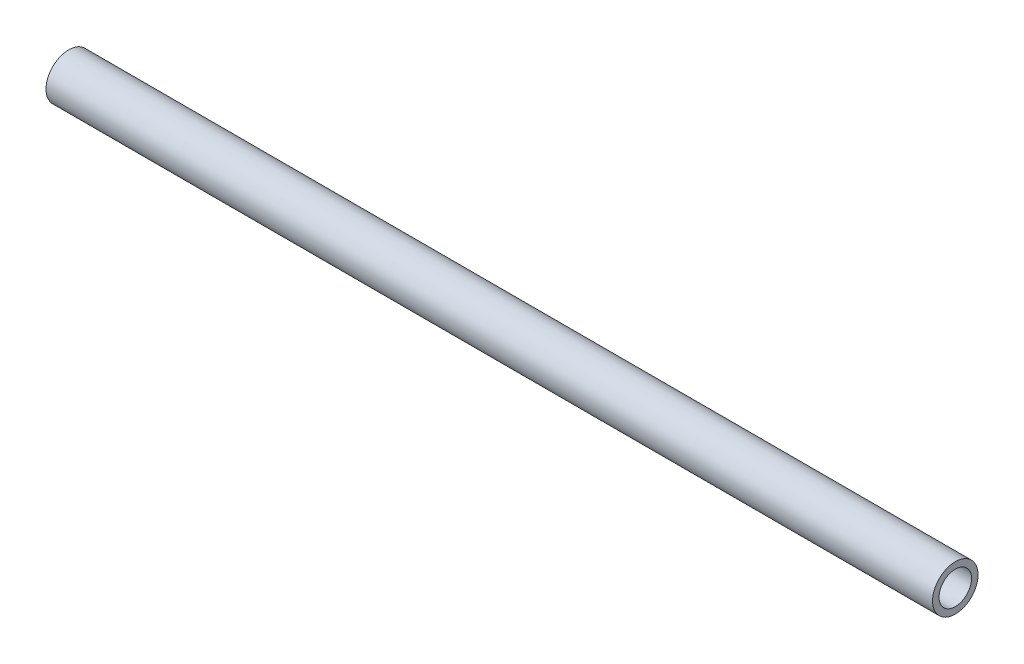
ISO-10303-21;
HEADER;
FILE_DESCRIPTION(('STEP AP214'),'2;1');
FILE_NAME('part.step','',(''),(''),'','','');
FILE_SCHEMA(('AUTOMOTIVE_DESIGN { 1 0 10303 214 1 1 1 1 }'));
ENDSEC;
DATA;
#1=APPLICATION_CONTEXT('core data for automotive mechanical design processes');
#2=APPLICATION_PROTOCOL_DEFINITION('international standard','automotive_design',2000,#1);
#3=PRODUCT_CONTEXT('',#1,'mechanical');
#4=PRODUCT('Part','Part','',(#3));
#5=PRODUCT_RELATED_PRODUCT_CATEGORY('part','',(#4));
#6=PRODUCT_DEFINITION_FORMATION('','',#4);
#7=PRODUCT_DEFINITION_CONTEXT('part definition',#1,'design');
#8=PRODUCT_DEFINITION('design','',#6,#7);
#9=PRODUCT_DEFINITION_SHAPE('','',#8);
#10=(LENGTH_UNIT() NAMED_UNIT(*) SI_UNIT(.MILLI.,.METRE.));
#11=(NAMED_UNIT(*) PLANE_ANGLE_UNIT() SI_UNIT($,.RADIAN.));
#12=(NAMED_UNIT(*) SI_UNIT($,.STERADIAN.) SOLID_ANGLE_UNIT());
#13=UNCERTAINTY_MEASURE_WITH_UNIT(LENGTH_MEASURE(1.E-05),#10,'distance_accuracy_value','');
#14=(GEOMETRIC_REPRESENTATION_CONTEXT(3) GLOBAL_UNCERTAINTY_ASSIGNED_CONTEXT((#13)) GLOBAL_UNIT_ASSIGNED_CONTEXT((#10,
#11,#12)) REPRESENTATION_CONTEXT('',''));
#15=CARTESIAN_POINT('',(0.,0.,0.));
#16=DIRECTION('',(0.,0.,1.));
#17=DIRECTION('',(1.,0.,0.));
#18=AXIS2_PLACEMENT_3D('',#15,#16,#17);
#19=CARTESIAN_POINT('',(415.925,0.,0.));
#20=DIRECTION('',(-1.,0.,0.));
#21=DIRECTION('',(0.,0.,1.));
#22=AXIS2_PLACEMENT_3D('',#19,#20,#21);
#23=CYLINDRICAL_SURFACE('',#22,7.62);
#24=CARTESIAN_POINT('',(415.925,0.,0.));
#25=DIRECTION('',(1.,0.,0.));
#26=DIRECTION('',(0.,0.,-1.));
#27=AXIS2_PLACEMENT_3D('',#24,#25,#26);
#28=CIRCLE('',#27,7.62);
#29=CARTESIAN_POINT('',(415.925,0.,7.62));
#30=VERTEX_POINT('',#29);
#31=EDGE_CURVE('E53',#30,#30,#28,.T.);
#32=CARTESIAN_POINT('',(0.,0.,0.));
#33=DIRECTION('',(1.,0.,0.));
#34=DIRECTION('',(0.,0.,-1.));
#35=AXIS2_PLACEMENT_3D('',#32,#33,#34);
#36=CIRCLE('',#35,7.62);
#37=CARTESIAN_POINT('',(0.,0.,7.62));
#38=VERTEX_POINT('',#37);
#39=EDGE_CURVE('E60',#38,#38,#36,.T.);
#40=CARTESIAN_POINT('',(415.925,0.,7.62));
#41=CARTESIAN_POINT('',(411.592447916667,0.,7.62));
#42=CARTESIAN_POINT('',(407.259895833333,0.,7.62));
#43=CARTESIAN_POINT('',(398.594791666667,0.,7.62));
#44=CARTESIAN_POINT('',(394.262239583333,0.,7.62));
#45=CARTESIAN_POINT('',(385.597135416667,0.,7.62));
#46=CARTESIAN_POINT('',(381.264583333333,0.,7.62));
#47=CARTESIAN_POINT('',(372.599479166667,0.,7.62));
#48=CARTESIAN_POINT('',(368.266927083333,0.,7.62));
#49=CARTESIAN_POINT('',(359.601822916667,0.,7.62));
#50=CARTESIAN_POINT('',(355.269270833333,0.,7.62));
#51=CARTESIAN_POINT('',(346.604166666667,0.,7.62));
#52=CARTESIAN_POINT('',(342.271614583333,0.,7.62));
#53=CARTESIAN_POINT('',(333.606510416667,0.,7.62));
#54=CARTESIAN_POINT('',(329.273958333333,0.,7.62));
#55=CARTESIAN_POINT('',(320.608854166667,0.,7.62));
#56=CARTESIAN_POINT('',(316.276302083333,0.,7.62));
#57=CARTESIAN_POINT('',(307.611197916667,0.,7.62));
#58=CARTESIAN_POINT('',(303.278645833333,0.,7.62));
#59=CARTESIAN_POINT('',(294.613541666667,0.,7.62));
#60=CARTESIAN_POINT('',(290.280989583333,0.,7.62));
#61=CARTESIAN_POINT('',(281.615885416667,0.,7.62));
#62=CARTESIAN_POINT('',(277.283333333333,0.,7.62));
#63=CARTESIAN_POINT('',(268.618229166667,0.,7.62));
#64=CARTESIAN_POINT('',(264.285677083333,0.,7.62));
#65=CARTESIAN_POINT('',(255.620572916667,0.,7.62));
#66=CARTESIAN_POINT('',(251.288020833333,0.,7.62));
#67=CARTESIAN_POINT('',(242.622916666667,0.,7.62));
#68=CARTESIAN_POINT('',(238.290364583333,0.,7.62));
#69=CARTESIAN_POINT('',(229.625260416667,0.,7.62));
#70=CARTESIAN_POINT('',(225.292708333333,0.,7.62));
#71=CARTESIAN_POINT('',(216.627604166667,0.,7.62));
#72=CARTESIAN_POINT('',(212.295052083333,0.,7.62));
#73=CARTESIAN_POINT('',(203.629947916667,0.,7.62));
#74=CARTESIAN_POINT('',(199.297395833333,0.,7.62));
#75=CARTESIAN_POINT('',(190.632291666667,0.,7.62));
#76=CARTESIAN_POINT('',(186.299739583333,0.,7.62));
#77=CARTESIAN_POINT('',(177.634635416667,0.,7.62));
#78=CARTESIAN_POINT('',(173.302083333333,0.,7.62));
#79=CARTESIAN_POINT('',(164.636979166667,0.,7.62));
#80=CARTESIAN_POINT('',(160.304427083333,0.,7.62));
#81=CARTESIAN_POINT('',(151.639322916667,0.,7.62));
#82=CARTESIAN_POINT('',(147.306770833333,0.,7.62));
#83=CARTESIAN_POINT('',(138.641666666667,0.,7.62));
#84=CARTESIAN_POINT('',(134.309114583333,0.,7.62));
#85=CARTESIAN_POINT('',(125.644010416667,0.,7.62));
#86=CARTESIAN_POINT('',(121.311458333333,0.,7.62));
#87=CARTESIAN_POINT('',(112.646354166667,0.,7.62));
#88=CARTESIAN_POINT('',(108.313802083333,0.,7.62));
#89=CARTESIAN_POINT('',(99.6486979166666,0.,7.62));
#90=CARTESIAN_POINT('',(95.3161458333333,0.,7.62));
#91=CARTESIAN_POINT('',(86.6510416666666,0.,7.62));
#92=CARTESIAN_POINT('',(82.3184895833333,0.,7.62));
#93=CARTESIAN_POINT('',(73.6533854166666,0.,7.62));
#94=CARTESIAN_POINT('',(69.3208333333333,0.,7.62));
#95=CARTESIAN_POINT('',(60.6557291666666,0.,7.62));
#96=CARTESIAN_POINT('',(56.3231770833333,0.,7.62));
#97=CARTESIAN_POINT('',(47.6580729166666,0.,7.62));
#98=CARTESIAN_POINT('',(43.3255208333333,0.,7.62));
#99=CARTESIAN_POINT('',(34.6604166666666,0.,7.62));
#100=CARTESIAN_POINT('',(30.3278645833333,0.,7.62));
#101=CARTESIAN_POINT('',(21.6627604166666,0.,7.62));
#102=CARTESIAN_POINT('',(17.3302083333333,0.,7.62));
#103=CARTESIAN_POINT('',(8.66510416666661,0.,7.62));
#104=CARTESIAN_POINT('',(4.33255208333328,0.,7.62));
#105=CARTESIAN_POINT('',(0.,0.,7.62));
#106=B_SPLINE_CURVE_WITH_KNOTS('',3,(#40,#41,#42,#43,#44,#45,#46,#47,#48,#49,#50,#51,#52,#53,
#54,#55,#56,#57,#58,#59,#60,#61,#62,#63,#64,#65,#66,#67,#68,#69,#70,#71,#72,#73,#74,#75,#76,#77,
#78,#79,#80,#81,#82,#83,#84,#85,#86,#87,#88,#89,#90,#91,#92,#93,#94,#95,#96,#97,#98,#99,#100,
#101,#102,#103,#104,#105),.UNSPECIFIED.,.F.,.F.,(4,2,2,2,2,2,2,2,2,2,2,2,2,2,2,2,2,2,2,2,2,2,2,
2,2,2,2,2,2,2,2,2,4),(0.,12.99765625,25.9953125,38.99296875,51.990625,64.9882812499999,
77.9859375,90.98359375,103.98125,116.97890625,129.9765625,142.97421875,155.971875,168.96953125,
181.9671875,194.96484375,207.9625,220.96015625,233.9578125,246.95546875,259.953125,272.95078125,
285.9484375,298.94609375,311.94375,324.94140625,337.9390625,350.93671875,363.934375,
376.93203125,389.9296875,402.92734375,415.925),.UNSPECIFIED.);
#107=EDGE_CURVE('BSEAM45',#30,#38,#106,.T.);
#108=ORIENTED_EDGE('',*,*,#31,.T.);
#109=ORIENTED_EDGE('',*,*,#39,.F.);
#110=ORIENTED_EDGE('',*,*,#107,.T.);
#111=ORIENTED_EDGE('',*,*,#107,.F.);
#112=EDGE_LOOP('',(#108,#110,#109,#111));
#113=FACE_BOUND('',#112,.T.);
#114=ADVANCED_FACE('F45',(#113),#23,.F.);
#115=CARTESIAN_POINT('',(415.925,0.,0.));
#116=DIRECTION('',(-1.,0.,0.));
#117=DIRECTION('',(0.,0.,1.));
#118=AXIS2_PLACEMENT_3D('',#115,#116,#117);
#119=CYLINDRICAL_SURFACE('',#118,10.668);
#120=CARTESIAN_POINT('',(415.925,0.,0.));
#121=DIRECTION('',(1.,0.,0.));
#122=DIRECTION('',(0.,0.,-1.));
#123=AXIS2_PLACEMENT_3D('',#120,#121,#122);
#124=CIRCLE('',#123,10.668);
#125=CARTESIAN_POINT('',(415.925,0.,10.668));
#126=VERTEX_POINT('',#125);
#127=EDGE_CURVE('E10',#126,#126,#124,.T.);
#128=CARTESIAN_POINT('',(0.,0.,0.));
#129=DIRECTION('',(1.,0.,0.));
#130=DIRECTION('',(0.,0.,-1.));
#131=AXIS2_PLACEMENT_3D('',#128,#129,#130);
#132=CIRCLE('',#131,10.668);
#133=CARTESIAN_POINT('',(0.,0.,10.668));
#134=VERTEX_POINT('',#133);
#135=EDGE_CURVE('E48',#134,#134,#132,.T.);
#136=CARTESIAN_POINT('',(415.925,0.,10.668));
#137=CARTESIAN_POINT('',(411.592447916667,0.,10.668));
#138=CARTESIAN_POINT('',(407.259895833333,0.,10.668));
#139=CARTESIAN_POINT('',(398.594791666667,0.,10.668));
#140=CARTESIAN_POINT('',(394.262239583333,0.,10.668));
#141=CARTESIAN_POINT('',(385.597135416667,0.,10.668));
#142=CARTESIAN_POINT('',(381.264583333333,0.,10.668));
#143=CARTESIAN_POINT('',(372.599479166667,0.,10.668));
#144=CARTESIAN_POINT('',(368.266927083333,0.,10.668));
#145=CARTESIAN_POINT('',(359.601822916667,0.,10.668));
#146=CARTESIAN_POINT('',(355.269270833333,0.,10.668));
#147=CARTESIAN_POINT('',(346.604166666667,0.,10.668));
#148=CARTESIAN_POINT('',(342.271614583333,0.,10.668));
#149=CARTESIAN_POINT('',(333.606510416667,0.,10.668));
#150=CARTESIAN_POINT('',(329.273958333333,0.,10.668));
#151=CARTESIAN_POINT('',(320.608854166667,0.,10.668));
#152=CARTESIAN_POINT('',(316.276302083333,0.,10.668));
#153=CARTESIAN_POINT('',(307.611197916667,0.,10.668));
#154=CARTESIAN_POINT('',(303.278645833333,0.,10.668));
#155=CARTESIAN_POINT('',(294.613541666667,0.,10.668));
#156=CARTESIAN_POINT('',(290.280989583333,0.,10.668));
#157=CARTESIAN_POINT('',(281.615885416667,0.,10.668));
#158=CARTESIAN_POINT('',(277.283333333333,0.,10.668));
#159=CARTESIAN_POINT('',(268.618229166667,0.,10.668));
#160=CARTESIAN_POINT('',(264.285677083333,0.,10.668));
#161=CARTESIAN_POINT('',(255.620572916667,0.,10.668));
#162=CARTESIAN_POINT('',(251.288020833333,0.,10.668));
#163=CARTESIAN_POINT('',(242.622916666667,0.,10.668));
#164=CARTESIAN_POINT('',(238.290364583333,0.,10.668));
#165=CARTESIAN_POINT('',(229.625260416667,0.,10.668));
#166=CARTESIAN_POINT('',(225.292708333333,0.,10.668));
#167=CARTESIAN_POINT('',(216.627604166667,0.,10.668));
#168=CARTESIAN_POINT('',(212.295052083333,0.,10.668));
#169=CARTESIAN_POINT('',(203.629947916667,0.,10.668));
#170=CARTESIAN_POINT('',(199.297395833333,0.,10.668));
#171=CARTESIAN_POINT('',(190.632291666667,0.,10.668));
#172=CARTESIAN_POINT('',(186.299739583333,0.,10.668));
#173=CARTESIAN_POINT('',(177.634635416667,0.,10.668));
#174=CARTESIAN_POINT('',(173.302083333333,0.,10.668));
#175=CARTESIAN_POINT('',(164.636979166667,0.,10.668));
#176=CARTESIAN_POINT('',(160.304427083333,0.,10.668));
#177=CARTESIAN_POINT('',(151.639322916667,0.,10.668));
#178=CARTESIAN_POINT('',(147.306770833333,0.,10.668));
#179=CARTESIAN_POINT('',(138.641666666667,0.,10.668));
#180=CARTESIAN_POINT('',(134.309114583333,0.,10.668));
#181=CARTESIAN_POINT('',(125.644010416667,0.,10.668));
#182=CARTESIAN_POINT('',(121.311458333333,0.,10.668));
#183=CARTESIAN_POINT('',(112.646354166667,0.,10.668));
#184=CARTESIAN_POINT('',(108.313802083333,0.,10.668));
#185=CARTESIAN_POINT('',(99.6486979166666,0.,10.668));
#186=CARTESIAN_POINT('',(95.3161458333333,0.,10.668));
#187=CARTESIAN_POINT('',(86.6510416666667,0.,10.668));
#188=CARTESIAN_POINT('',(82.3184895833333,0.,10.668));
#189=CARTESIAN_POINT('',(73.6533854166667,0.,10.668));
#190=CARTESIAN_POINT('',(69.3208333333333,0.,10.668));
#191=CARTESIAN_POINT('',(60.6557291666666,0.,10.668));
#192=CARTESIAN_POINT('',(56.3231770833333,0.,10.668));
#193=CARTESIAN_POINT('',(47.6580729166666,0.,10.668));
#194=CARTESIAN_POINT('',(43.3255208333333,0.,10.668));
#195=CARTESIAN_POINT('',(34.6604166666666,0.,10.668));
#196=CARTESIAN_POINT('',(30.3278645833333,0.,10.668));
#197=CARTESIAN_POINT('',(21.6627604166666,0.,10.668));
#198=CARTESIAN_POINT('',(17.3302083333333,0.,10.668));
#199=CARTESIAN_POINT('',(8.66510416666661,0.,10.668));
#200=CARTESIAN_POINT('',(4.33255208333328,0.,10.668));
#201=CARTESIAN_POINT('',(0.,0.,10.668));
#202=B_SPLINE_CURVE_WITH_KNOTS('',3,(#136,#137,#138,#139,#140,#141,#142,#143,#144,#145,#146,
#147,#148,#149,#150,#151,#152,#153,#154,#155,#156,#157,#158,#159,#160,#161,#162,#163,#164,#165,
#166,#167,#168,#169,#170,#171,#172,#173,#174,#175,#176,#177,#178,#179,#180,#181,#182,#183,#184,
#185,#186,#187,#188,#189,#190,#191,#192,#193,#194,#195,#196,#197,#198,#199,#200,#201),
.UNSPECIFIED.,.F.,.F.,(4,2,2,2,2,2,2,2,2,2,2,2,2,2,2,2,2,2,2,2,2,2,2,2,2,2,2,2,2,2,2,2,4),(0.,
12.99765625,25.9953125,38.99296875,51.990625,64.98828125,77.9859375,90.98359375,103.98125,
116.97890625,129.9765625,142.97421875,155.971875,168.96953125,181.9671875,194.96484375,207.9625,
220.96015625,233.9578125,246.95546875,259.953125,272.95078125,285.9484375,298.94609375,
311.94375,324.94140625,337.9390625,350.93671875,363.934375,376.93203125,389.9296875,
402.92734375,415.925),.UNSPECIFIED.);
#203=EDGE_CURVE('BSEAM69',#126,#134,#202,.T.);
#204=ORIENTED_EDGE('',*,*,#127,.F.);
#205=ORIENTED_EDGE('',*,*,#135,.T.);
#206=ORIENTED_EDGE('',*,*,#203,.T.);
#207=ORIENTED_EDGE('',*,*,#203,.F.);
#208=EDGE_LOOP('',(#204,#206,#205,#207));
#209=FACE_BOUND('',#208,.T.);
#210=ADVANCED_FACE('F69',(#209),#119,.T.);
#211=CARTESIAN_POINT('',(415.925,0.,0.));
#212=DIRECTION('',(1.,0.,0.));
#213=DIRECTION('',(0.,0.,-1.));
#214=AXIS2_PLACEMENT_3D('',#211,#212,#213);
#215=PLANE('',#214);
#216=ORIENTED_EDGE('',*,*,#31,.F.);
#217=EDGE_LOOP('',(#216));
#218=FACE_BOUND('',#217,.T.);
#219=ORIENTED_EDGE('',*,*,#127,.T.);
#220=EDGE_LOOP('',(#219));
#221=FACE_BOUND('',#220,.T.);
#222=ADVANCED_FACE('F73',(#218,#221),#215,.T.);
#223=CARTESIAN_POINT('',(0.,0.,0.));
#224=DIRECTION('',(1.,0.,0.));
#225=DIRECTION('',(0.,0.,-1.));
#226=AXIS2_PLACEMENT_3D('',#223,#224,#225);
#227=PLANE('',#226);
#228=ORIENTED_EDGE('',*,*,#39,.T.);
#229=EDGE_LOOP('',(#228));
#230=FACE_BOUND('',#229,.T.);
#231=ORIENTED_EDGE('',*,*,#135,.F.);
#232=EDGE_LOOP('',(#231));
#233=FACE_BOUND('',#232,.T.);
#234=ADVANCED_FACE('F71',(#230,#233),#227,.F.);
#235=CLOSED_SHELL('',(#114,#210,#222,#234));
#236=MANIFOLD_SOLID_BREP('B2',#235);
#237=ADVANCED_BREP_SHAPE_REPRESENTATION('',(#18,#236),#14);
#238=SHAPE_DEFINITION_REPRESENTATION(#9,#237);
ENDSEC;
END-ISO-10303-21;
